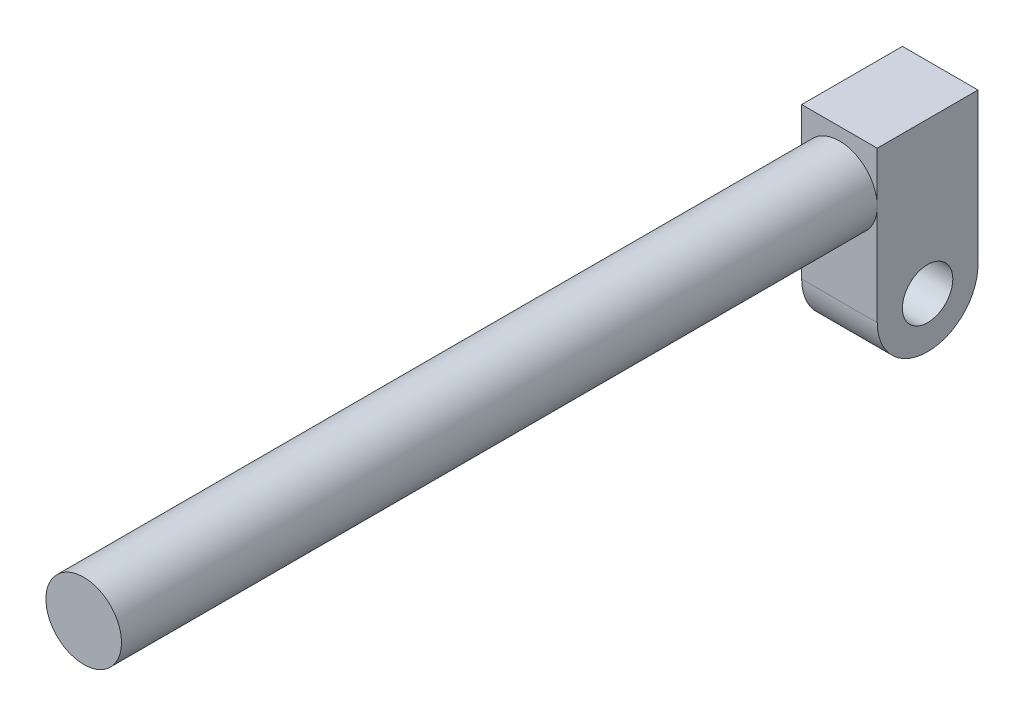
ISO-10303-21;
HEADER;
FILE_DESCRIPTION(('STEP AP214'),'2;1');
FILE_NAME('part.step','',(''),(''),'','','');
FILE_SCHEMA(('AUTOMOTIVE_DESIGN { 1 0 10303 214 1 1 1 1 }'));
ENDSEC;
DATA;
#1=APPLICATION_CONTEXT('core data for automotive mechanical design processes');
#2=APPLICATION_PROTOCOL_DEFINITION('international standard','automotive_design',2000,#1);
#3=PRODUCT_CONTEXT('',#1,'mechanical');
#4=PRODUCT('Part','Part','',(#3));
#5=PRODUCT_RELATED_PRODUCT_CATEGORY('part','',(#4));
#6=PRODUCT_DEFINITION_FORMATION('','',#4);
#7=PRODUCT_DEFINITION_CONTEXT('part definition',#1,'design');
#8=PRODUCT_DEFINITION('design','',#6,#7);
#9=PRODUCT_DEFINITION_SHAPE('','',#8);
#10=(LENGTH_UNIT() NAMED_UNIT(*) SI_UNIT(.MILLI.,.METRE.));
#11=(NAMED_UNIT(*) PLANE_ANGLE_UNIT() SI_UNIT($,.RADIAN.));
#12=(NAMED_UNIT(*) SI_UNIT($,.STERADIAN.) SOLID_ANGLE_UNIT());
#13=UNCERTAINTY_MEASURE_WITH_UNIT(LENGTH_MEASURE(1.E-05),#10,'distance_accuracy_value','');
#14=(GEOMETRIC_REPRESENTATION_CONTEXT(3) GLOBAL_UNCERTAINTY_ASSIGNED_CONTEXT((#13)) GLOBAL_UNIT_ASSIGNED_CONTEXT((#10,
#11,#12)) REPRESENTATION_CONTEXT('',''));
#15=CARTESIAN_POINT('',(0.,0.,0.));
#16=DIRECTION('',(0.,0.,1.));
#17=DIRECTION('',(1.,0.,0.));
#18=AXIS2_PLACEMENT_3D('',#15,#16,#17);
#19=CARTESIAN_POINT('',(30.,0.,40.));
#20=DIRECTION('',(0.,0.,1.));
#21=DIRECTION('',(0.,-1.,0.));
#22=AXIS2_PLACEMENT_3D('',#19,#20,#21);
#23=PLANE('',#22);
#24=DIRECTION('',(0.,1.,0.));
#25=VECTOR('',#24,1.);
#26=CARTESIAN_POINT('',(-30.,0.,40.));
#27=LINE('',#26,#25);
#28=CARTESIAN_POINT('',(-30.,80.,40.));
#29=VERTEX_POINT('',#28);
#30=CARTESIAN_POINT('',(-30.,120.,40.));
#31=VERTEX_POINT('',#30);
#32=EDGE_CURVE('E85',#29,#31,#27,.T.);
#33=ORIENTED_EDGE('',*,*,#32,.F.);
#34=CARTESIAN_POINT('',(0.,80.,40.));
#35=DIRECTION('',(0.,0.,1.));
#36=DIRECTION('',(1.,0.,0.));
#37=AXIS2_PLACEMENT_3D('',#34,#35,#36);
#38=CIRCLE('',#37,30.);
#39=CARTESIAN_POINT('',(30.,80.,40.));
#40=VERTEX_POINT('',#39);
#41=EDGE_CURVE('E55',#40,#29,#38,.T.);
#42=ORIENTED_EDGE('',*,*,#41,.F.);
#43=DIRECTION('',(0.,1.,0.));
#44=VECTOR('',#43,1.);
#45=CARTESIAN_POINT('',(30.,0.,40.));
#46=LINE('',#45,#44);
#47=CARTESIAN_POINT('',(30.,120.,40.));
#48=VERTEX_POINT('',#47);
#49=EDGE_CURVE('E63',#40,#48,#46,.T.);
#50=ORIENTED_EDGE('',*,*,#49,.T.);
#51=DIRECTION('',(-1.,0.,0.));
#52=VECTOR('',#51,1.);
#53=CARTESIAN_POINT('',(30.,120.,40.));
#54=LINE('',#53,#52);
#55=EDGE_CURVE('E120',#48,#31,#54,.T.);
#56=ORIENTED_EDGE('',*,*,#55,.T.);
#57=EDGE_LOOP('',(#33,#42,#50,#56));
#58=FACE_BOUND('',#57,.T.);
#59=ADVANCED_FACE('F41',(#58),#23,.T.);
#60=CARTESIAN_POINT('',(30.,0.,40.));
#61=VERTEX_POINT('',#60);
#62=EDGE_CURVE('E103',#61,#40,#46,.T.);
#63=ORIENTED_EDGE('',*,*,#62,.T.);
#64=EDGE_CURVE('E94',#29,#40,#38,.T.);
#65=ORIENTED_EDGE('',*,*,#64,.F.);
#66=CARTESIAN_POINT('',(-30.,0.,40.));
#67=VERTEX_POINT('',#66);
#68=EDGE_CURVE('E121',#67,#29,#27,.T.);
#69=ORIENTED_EDGE('',*,*,#68,.F.);
#70=DIRECTION('',(-1.,0.,0.));
#71=VECTOR('',#70,1.);
#72=CARTESIAN_POINT('',(30.,0.,40.));
#73=LINE('',#72,#71);
#74=EDGE_CURVE('E11',#61,#67,#73,.T.);
#75=ORIENTED_EDGE('',*,*,#74,.F.);
#76=EDGE_LOOP('',(#63,#65,#69,#75));
#77=FACE_BOUND('',#76,.T.);
#78=ADVANCED_FACE('F43',(#77),#23,.T.);
#79=CARTESIAN_POINT('',(30.,0.,0.));
#80=DIRECTION('',(-1.,0.,0.));
#81=DIRECTION('',(0.,0.,1.));
#82=AXIS2_PLACEMENT_3D('',#79,#80,#81);
#83=CYLINDRICAL_SURFACE('',#82,40.);
#84=CARTESIAN_POINT('',(-30.,0.,0.));
#85=DIRECTION('',(1.,0.,0.));
#86=DIRECTION('',(0.,0.,-1.));
#87=AXIS2_PLACEMENT_3D('',#84,#85,#86);
#88=CIRCLE('',#87,40.);
#89=CARTESIAN_POINT('',(-30.,0.,-40.));
#90=VERTEX_POINT('',#89);
#91=EDGE_CURVE('E123',#67,#90,#88,.T.);
#92=ORIENTED_EDGE('',*,*,#91,.T.);
#93=DIRECTION('',(-1.,0.,0.));
#94=VECTOR('',#93,1.);
#95=CARTESIAN_POINT('',(30.,0.,-40.));
#96=LINE('',#95,#94);
#97=CARTESIAN_POINT('',(30.,0.,-40.));
#98=VERTEX_POINT('',#97);
#99=EDGE_CURVE('E49',#98,#90,#96,.T.);
#100=ORIENTED_EDGE('',*,*,#99,.F.);
#101=CARTESIAN_POINT('',(30.,0.,0.));
#102=DIRECTION('',(1.,0.,0.));
#103=DIRECTION('',(0.,0.,-1.));
#104=AXIS2_PLACEMENT_3D('',#101,#102,#103);
#105=CIRCLE('',#104,40.);
#106=EDGE_CURVE('E109',#61,#98,#105,.T.);
#107=ORIENTED_EDGE('',*,*,#106,.F.);
#108=ORIENTED_EDGE('',*,*,#74,.T.);
#109=EDGE_LOOP('',(#92,#100,#107,#108));
#110=FACE_BOUND('',#109,.T.);
#111=ADVANCED_FACE('F141',(#110),#83,.T.);
#112=CARTESIAN_POINT('',(30.,0.,-40.));
#113=DIRECTION('',(0.,0.,-1.));
#114=DIRECTION('',(0.,1.,0.));
#115=AXIS2_PLACEMENT_3D('',#112,#113,#114);
#116=PLANE('',#115);
#117=DIRECTION('',(0.,-1.,0.));
#118=VECTOR('',#117,1.);
#119=CARTESIAN_POINT('',(-30.,0.,-40.));
#120=LINE('',#119,#118);
#121=CARTESIAN_POINT('',(-30.,120.,-40.));
#122=VERTEX_POINT('',#121);
#123=EDGE_CURVE('E126',#122,#90,#120,.T.);
#124=ORIENTED_EDGE('',*,*,#123,.F.);
#125=DIRECTION('',(-1.,0.,0.));
#126=VECTOR('',#125,1.);
#127=CARTESIAN_POINT('',(30.,120.,-40.));
#128=LINE('',#127,#126);
#129=CARTESIAN_POINT('',(30.,120.,-40.));
#130=VERTEX_POINT('',#129);
#131=EDGE_CURVE('E134',#130,#122,#128,.T.);
#132=ORIENTED_EDGE('',*,*,#131,.F.);
#133=DIRECTION('',(0.,-1.,0.));
#134=VECTOR('',#133,1.);
#135=CARTESIAN_POINT('',(30.,0.,-40.));
#136=LINE('',#135,#134);
#137=EDGE_CURVE('E110',#130,#98,#136,.T.);
#138=ORIENTED_EDGE('',*,*,#137,.T.);
#139=ORIENTED_EDGE('',*,*,#99,.T.);
#140=EDGE_LOOP('',(#124,#132,#138,#139));
#141=FACE_BOUND('',#140,.T.);
#142=ADVANCED_FACE('F138',(#141),#116,.T.);
#143=CARTESIAN_POINT('',(30.,120.,0.));
#144=DIRECTION('',(0.,1.,0.));
#145=DIRECTION('',(0.,0.,1.));
#146=AXIS2_PLACEMENT_3D('',#143,#144,#145);
#147=PLANE('',#146);
#148=DIRECTION('',(0.,0.,-1.));
#149=VECTOR('',#148,1.);
#150=CARTESIAN_POINT('',(-30.,120.,0.));
#151=LINE('',#150,#149);
#152=EDGE_CURVE('E129',#31,#122,#151,.T.);
#153=ORIENTED_EDGE('',*,*,#152,.F.);
#154=ORIENTED_EDGE('',*,*,#55,.F.);
#155=DIRECTION('',(0.,0.,-1.));
#156=VECTOR('',#155,1.);
#157=CARTESIAN_POINT('',(30.,120.,0.));
#158=LINE('',#157,#156);
#159=EDGE_CURVE('E106',#48,#130,#158,.T.);
#160=ORIENTED_EDGE('',*,*,#159,.T.);
#161=ORIENTED_EDGE('',*,*,#131,.T.);
#162=EDGE_LOOP('',(#153,#154,#160,#161));
#163=FACE_BOUND('',#162,.T.);
#164=ADVANCED_FACE('F146',(#163),#147,.T.);
#165=CARTESIAN_POINT('',(30.,0.,0.));
#166=DIRECTION('',(-1.,0.,0.));
#167=DIRECTION('',(0.,0.,1.));
#168=AXIS2_PLACEMENT_3D('',#165,#166,#167);
#169=CYLINDRICAL_SURFACE('',#168,20.);
#170=CARTESIAN_POINT('',(30.,0.,0.));
#171=DIRECTION('',(1.,0.,0.));
#172=DIRECTION('',(0.,0.,-1.));
#173=AXIS2_PLACEMENT_3D('',#170,#171,#172);
#174=CIRCLE('',#173,20.);
#175=CARTESIAN_POINT('',(30.,0.,-20.));
#176=VERTEX_POINT('',#175);
#177=EDGE_CURVE('E117',#176,#176,#174,.T.);
#178=ORIENTED_EDGE('',*,*,#177,.T.);
#179=EDGE_LOOP('',(#178));
#180=FACE_BOUND('',#179,.T.);
#181=CARTESIAN_POINT('',(-30.,0.,0.));
#182=DIRECTION('',(1.,0.,0.));
#183=DIRECTION('',(0.,0.,-1.));
#184=AXIS2_PLACEMENT_3D('',#181,#182,#183);
#185=CIRCLE('',#184,20.);
#186=CARTESIAN_POINT('',(-30.,0.,-20.));
#187=VERTEX_POINT('',#186);
#188=EDGE_CURVE('E107',#187,#187,#185,.T.);
#189=ORIENTED_EDGE('',*,*,#188,.F.);
#190=EDGE_LOOP('',(#189));
#191=FACE_BOUND('',#190,.T.);
#192=ADVANCED_FACE('F148',(#180,#191),#169,.F.);
#193=CARTESIAN_POINT('',(30.,0.,0.));
#194=DIRECTION('',(1.,0.,0.));
#195=DIRECTION('',(0.,0.,-1.));
#196=AXIS2_PLACEMENT_3D('',#193,#194,#195);
#197=PLANE('',#196);
#198=ORIENTED_EDGE('',*,*,#62,.F.);
#199=ORIENTED_EDGE('',*,*,#106,.T.);
#200=ORIENTED_EDGE('',*,*,#137,.F.);
#201=ORIENTED_EDGE('',*,*,#159,.F.);
#202=ORIENTED_EDGE('',*,*,#49,.F.);
#203=EDGE_LOOP('',(#198,#199,#200,#201,#202));
#204=FACE_BOUND('',#203,.T.);
#205=ORIENTED_EDGE('',*,*,#177,.F.);
#206=EDGE_LOOP('',(#205));
#207=FACE_BOUND('',#206,.T.);
#208=ADVANCED_FACE('F101',(#204,#207),#197,.T.);
#209=CARTESIAN_POINT('',(-30.,0.,0.));
#210=DIRECTION('',(1.,0.,0.));
#211=DIRECTION('',(0.,0.,-1.));
#212=AXIS2_PLACEMENT_3D('',#209,#210,#211);
#213=PLANE('',#212);
#214=ORIENTED_EDGE('',*,*,#68,.T.);
#215=ORIENTED_EDGE('',*,*,#32,.T.);
#216=ORIENTED_EDGE('',*,*,#152,.T.);
#217=ORIENTED_EDGE('',*,*,#123,.T.);
#218=ORIENTED_EDGE('',*,*,#91,.F.);
#219=EDGE_LOOP('',(#214,#215,#216,#217,#218));
#220=FACE_BOUND('',#219,.T.);
#221=ORIENTED_EDGE('',*,*,#188,.T.);
#222=EDGE_LOOP('',(#221));
#223=FACE_BOUND('',#222,.T.);
#224=ADVANCED_FACE('F142',(#220,#223),#213,.F.);
#225=CARTESIAN_POINT('',(0.,80.,640.));
#226=DIRECTION('',(0.,0.,-1.));
#227=DIRECTION('',(-1.,0.,0.));
#228=AXIS2_PLACEMENT_3D('',#225,#226,#227);
#229=CYLINDRICAL_SURFACE('',#228,30.);
#230=CARTESIAN_POINT('',(0.,80.,640.));
#231=DIRECTION('',(0.,0.,1.));
#232=DIRECTION('',(1.,0.,0.));
#233=AXIS2_PLACEMENT_3D('',#230,#231,#232);
#234=CIRCLE('',#233,30.);
#235=CARTESIAN_POINT('',(30.,80.,640.));
#236=VERTEX_POINT('',#235);
#237=EDGE_CURVE('E97',#236,#236,#234,.T.);
#238=ORIENTED_EDGE('',*,*,#237,.F.);
#239=EDGE_LOOP('',(#238));
#240=FACE_BOUND('',#239,.T.);
#241=ORIENTED_EDGE('',*,*,#41,.T.);
#242=ORIENTED_EDGE('',*,*,#64,.T.);
#243=EDGE_LOOP('',(#241,#242));
#244=FACE_BOUND('',#243,.T.);
#245=ADVANCED_FACE('F95',(#240,#244),#229,.T.);
#246=CARTESIAN_POINT('',(0.,0.,640.));
#247=DIRECTION('',(0.,0.,1.));
#248=DIRECTION('',(1.,0.,0.));
#249=AXIS2_PLACEMENT_3D('',#246,#247,#248);
#250=PLANE('',#249);
#251=ORIENTED_EDGE('',*,*,#237,.T.);
#252=EDGE_LOOP('',(#251));
#253=FACE_BOUND('',#252,.T.);
#254=ADVANCED_FACE('F221',(#253),#250,.T.);
#255=CLOSED_SHELL('',(#59,#78,#111,#142,#164,#192,#208,#224,#245,#254));
#256=MANIFOLD_SOLID_BREP('B2',#255);
#257=ADVANCED_BREP_SHAPE_REPRESENTATION('',(#18,#256),#14);
#258=SHAPE_DEFINITION_REPRESENTATION(#9,#257);
ENDSEC;
END-ISO-10303-21;
